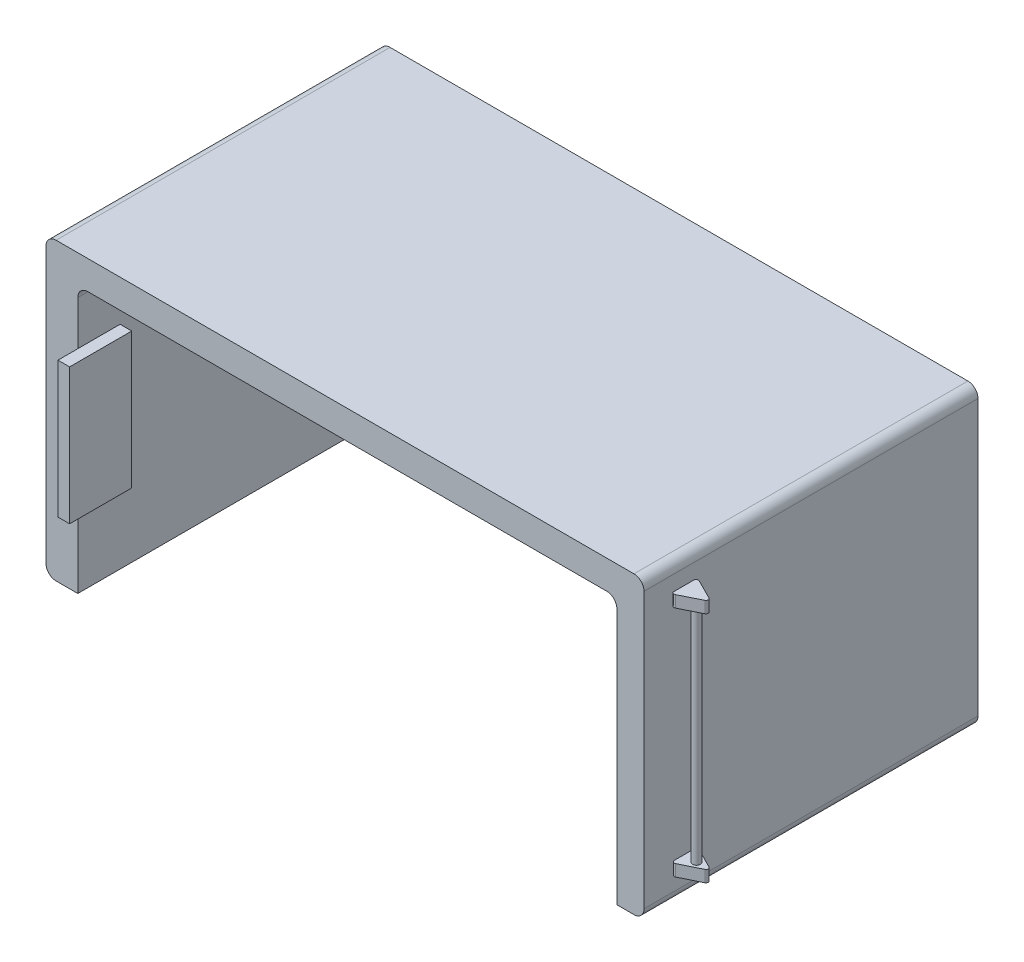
ISO-10303-21;
HEADER;
FILE_DESCRIPTION(('STEP AP214'),'2;1');
FILE_NAME('part.step','',(''),(''),'','','');
FILE_SCHEMA(('AUTOMOTIVE_DESIGN { 1 0 10303 214 1 1 1 1 }'));
ENDSEC;
DATA;
#1=APPLICATION_CONTEXT('core data for automotive mechanical design processes');
#2=APPLICATION_PROTOCOL_DEFINITION('international standard','automotive_design',2000,#1);
#3=PRODUCT_CONTEXT('',#1,'mechanical');
#4=PRODUCT('Part','Part','',(#3));
#5=PRODUCT_RELATED_PRODUCT_CATEGORY('part','',(#4));
#6=PRODUCT_DEFINITION_FORMATION('','',#4);
#7=PRODUCT_DEFINITION_CONTEXT('part definition',#1,'design');
#8=PRODUCT_DEFINITION('design','',#6,#7);
#9=PRODUCT_DEFINITION_SHAPE('','',#8);
#10=(LENGTH_UNIT() NAMED_UNIT(*) SI_UNIT(.MILLI.,.METRE.));
#11=(NAMED_UNIT(*) PLANE_ANGLE_UNIT() SI_UNIT($,.RADIAN.));
#12=(NAMED_UNIT(*) SI_UNIT($,.STERADIAN.) SOLID_ANGLE_UNIT());
#13=UNCERTAINTY_MEASURE_WITH_UNIT(LENGTH_MEASURE(1.E-05),#10,'distance_accuracy_value','');
#14=(GEOMETRIC_REPRESENTATION_CONTEXT(3) GLOBAL_UNCERTAINTY_ASSIGNED_CONTEXT((#13)) GLOBAL_UNIT_ASSIGNED_CONTEXT((#10,
#11,#12)) REPRESENTATION_CONTEXT('',''));
#15=CARTESIAN_POINT('',(0.,0.,0.));
#16=DIRECTION('',(0.,0.,1.));
#17=DIRECTION('',(1.,0.,0.));
#18=AXIS2_PLACEMENT_3D('',#15,#16,#17);
#19=CARTESIAN_POINT('',(-688.129187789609,-380.,860.));
#20=DIRECTION('',(-1.,0.,0.));
#21=DIRECTION('',(0.,0.,1.));
#22=AXIS2_PLACEMENT_3D('',#19,#20,#21);
#23=PLANE('',#22);
#24=DIRECTION('',(0.,0.,1.));
#25=VECTOR('',#24,1.);
#26=CARTESIAN_POINT('',(-688.129187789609,165.956022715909,751.059913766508));
#27=LINE('',#26,#25);
#28=CARTESIAN_POINT('',(-688.129187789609,165.956022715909,751.059913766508));
#29=VERTEX_POINT('',#28);
#30=CARTESIAN_POINT('',(-688.129187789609,165.956022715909,860.));
#31=VERTEX_POINT('',#30);
#32=EDGE_CURVE('E50',#29,#31,#27,.T.);
#33=ORIENTED_EDGE('',*,*,#32,.F.);
#34=DIRECTION('',(0.,1.,0.));
#35=VECTOR('',#34,1.);
#36=CARTESIAN_POINT('',(-688.129187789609,-184.043977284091,751.059913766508));
#37=LINE('',#36,#35);
#38=CARTESIAN_POINT('',(-688.129187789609,-184.043977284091,751.059913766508));
#39=VERTEX_POINT('',#38);
#40=EDGE_CURVE('E638',#39,#29,#37,.T.);
#41=ORIENTED_EDGE('',*,*,#40,.F.);
#42=DIRECTION('',(0.,0.,-1.));
#43=VECTOR('',#42,1.);
#44=CARTESIAN_POINT('',(-688.129187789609,-184.043977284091,751.059913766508));
#45=LINE('',#44,#43);
#46=CARTESIAN_POINT('',(-688.129187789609,-184.043977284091,860.));
#47=VERTEX_POINT('',#46);
#48=EDGE_CURVE('E683',#47,#39,#45,.T.);
#49=ORIENTED_EDGE('',*,*,#48,.F.);
#50=DIRECTION('',(0.,1.,0.));
#51=VECTOR('',#50,1.);
#52=CARTESIAN_POINT('',(-688.129187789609,-380.,860.));
#53=LINE('',#52,#51);
#54=CARTESIAN_POINT('',(-688.129187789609,-380.,860.));
#55=VERTEX_POINT('',#54);
#56=EDGE_CURVE('E795',#55,#47,#53,.T.);
#57=ORIENTED_EDGE('',*,*,#56,.F.);
#58=DIRECTION('',(0.,0.,-1.));
#59=VECTOR('',#58,1.);
#60=CARTESIAN_POINT('',(-688.129187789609,-380.,860.));
#61=LINE('',#60,#59);
#62=CARTESIAN_POINT('',(-688.129187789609,-380.,39.9999999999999));
#63=VERTEX_POINT('',#62);
#64=EDGE_CURVE('E848',#55,#63,#61,.T.);
#65=ORIENTED_EDGE('',*,*,#64,.T.);
#66=DIRECTION('',(0.,-1.,0.));
#67=VECTOR('',#66,1.);
#68=CARTESIAN_POINT('',(-688.129187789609,-380.,39.9999999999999));
#69=LINE('',#68,#67);
#70=CARTESIAN_POINT('',(-688.129187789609,280.184066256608,39.9999999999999));
#71=VERTEX_POINT('',#70);
#72=EDGE_CURVE('E762',#71,#63,#69,.T.);
#73=ORIENTED_EDGE('',*,*,#72,.F.);
#74=DIRECTION('',(0.,0.,-1.));
#75=VECTOR('',#74,1.);
#76=CARTESIAN_POINT('',(-688.129187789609,280.184066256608,860.));
#77=LINE('',#76,#75);
#78=CARTESIAN_POINT('',(-688.129187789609,280.184066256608,860.));
#79=VERTEX_POINT('',#78);
#80=EDGE_CURVE('E845',#79,#71,#77,.T.);
#81=ORIENTED_EDGE('',*,*,#80,.F.);
#82=EDGE_CURVE('E794',#31,#79,#53,.T.);
#83=ORIENTED_EDGE('',*,*,#82,.F.);
#84=EDGE_LOOP('',(#33,#41,#49,#57,#65,#73,#81,#83));
#85=FACE_BOUND('',#84,.T.);
#86=ADVANCED_FACE('F35',(#85),#23,.F.);
#87=CARTESIAN_POINT('',(826.583175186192,-285.,757.475724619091));
#88=DIRECTION('',(0.,-1.,0.));
#89=DIRECTION('',(0.,0.,-1.));
#90=AXIS2_PLACEMENT_3D('',#87,#88,#89);
#91=CYLINDRICAL_SURFACE('',#90,5.99999999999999);
#92=CARTESIAN_POINT('',(826.583175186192,-315.,757.475724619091));
#93=DIRECTION('',(0.,1.,0.));
#94=DIRECTION('',(0.,0.,-1.));
#95=AXIS2_PLACEMENT_3D('',#92,#93,#94);
#96=CIRCLE('',#95,5.99999999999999);
#97=CARTESIAN_POINT('',(829.223897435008,-315.,762.8633573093));
#98=VERTEX_POINT('',#97);
#99=CARTESIAN_POINT('',(829.308515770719,-315.,752.130397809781));
#100=VERTEX_POINT('',#99);
#101=EDGE_CURVE('E141',#98,#100,#96,.T.);
#102=ORIENTED_EDGE('',*,*,#101,.T.);
#103=DIRECTION('',(0.,-1.,0.));
#104=VECTOR('',#103,1.);
#105=CARTESIAN_POINT('',(829.308515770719,-285.,752.130397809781));
#106=LINE('',#105,#104);
#107=CARTESIAN_POINT('',(829.308515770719,-285.,752.130397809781));
#108=VERTEX_POINT('',#107);
#109=EDGE_CURVE('E11',#108,#100,#106,.T.);
#110=ORIENTED_EDGE('',*,*,#109,.F.);
#111=CARTESIAN_POINT('',(826.583175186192,-285.,757.475724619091));
#112=DIRECTION('',(0.,1.,0.));
#113=DIRECTION('',(0.,0.,-1.));
#114=AXIS2_PLACEMENT_3D('',#111,#112,#113);
#115=CIRCLE('',#114,5.99999999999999);
#116=CARTESIAN_POINT('',(829.223897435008,-285.,762.8633573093));
#117=VERTEX_POINT('',#116);
#118=EDGE_CURVE('E146',#117,#108,#115,.T.);
#119=ORIENTED_EDGE('',*,*,#118,.F.);
#120=DIRECTION('',(0.,-1.,0.));
#121=VECTOR('',#120,1.);
#122=CARTESIAN_POINT('',(829.223897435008,-285.,762.8633573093));
#123=LINE('',#122,#121);
#124=EDGE_CURVE('E125',#117,#98,#123,.T.);
#125=ORIENTED_EDGE('',*,*,#124,.T.);
#126=EDGE_LOOP('',(#102,#110,#119,#125));
#127=FACE_BOUND('',#126,.T.);
#128=ADVANCED_FACE('F37',(#127),#91,.T.);
#129=CARTESIAN_POINT('',(778.725340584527,-285.,726.340322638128));
#130=DIRECTION('',(-0.454223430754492,0.,0.890887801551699));
#131=DIRECTION('',(0.890887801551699,0.,0.454223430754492));
#132=AXIS2_PLACEMENT_3D('',#129,#130,#131);
#133=PLANE('',#132);
#134=DIRECTION('',(-0.890887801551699,0.,-0.454223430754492));
#135=VECTOR('',#134,1.);
#136=CARTESIAN_POINT('',(778.725340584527,-315.,726.340322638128));
#137=LINE('',#136,#135);
#138=CARTESIAN_POINT('',(778.725340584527,-315.,726.340322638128));
#139=VERTEX_POINT('',#138);
#140=EDGE_CURVE('E136',#100,#139,#137,.T.);
#141=ORIENTED_EDGE('',*,*,#140,.T.);
#142=DIRECTION('',(0.,-1.,0.));
#143=VECTOR('',#142,1.);
#144=CARTESIAN_POINT('',(778.725340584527,-285.,726.340322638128));
#145=LINE('',#144,#143);
#146=CARTESIAN_POINT('',(778.725340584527,-285.,726.340322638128));
#147=VERTEX_POINT('',#146);
#148=EDGE_CURVE('E43',#147,#139,#145,.T.);
#149=ORIENTED_EDGE('',*,*,#148,.F.);
#150=DIRECTION('',(-0.890887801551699,0.,-0.454223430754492));
#151=VECTOR('',#150,1.);
#152=CARTESIAN_POINT('',(778.725340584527,-285.,726.340322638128));
#153=LINE('',#152,#151);
#154=EDGE_CURVE('E91',#108,#147,#153,.T.);
#155=ORIENTED_EDGE('',*,*,#154,.F.);
#156=ORIENTED_EDGE('',*,*,#109,.T.);
#157=EDGE_LOOP('',(#141,#149,#155,#156));
#158=FACE_BOUND('',#157,.T.);
#159=ADVANCED_FACE('F165',(#158),#133,.F.);
#160=CARTESIAN_POINT('',(776.,-285.,731.685649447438));
#161=DIRECTION('',(0.,-1.,0.));
#162=DIRECTION('',(0.,0.,-1.));
#163=AXIS2_PLACEMENT_3D('',#160,#161,#162);
#164=CYLINDRICAL_SURFACE('',#163,5.99999999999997);
#165=CARTESIAN_POINT('',(776.,-315.,731.685649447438));
#166=DIRECTION('',(0.,1.,0.));
#167=DIRECTION('',(0.,0.,-1.));
#168=AXIS2_PLACEMENT_3D('',#165,#166,#167);
#169=CIRCLE('',#168,5.99999999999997);
#170=CARTESIAN_POINT('',(770.,-315.,731.685649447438));
#171=VERTEX_POINT('',#170);
#172=EDGE_CURVE('E132',#139,#171,#169,.T.);
#173=ORIENTED_EDGE('',*,*,#172,.T.);
#174=DIRECTION('',(0.,-1.,0.));
#175=VECTOR('',#174,1.);
#176=CARTESIAN_POINT('',(770.,-285.,731.685649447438));
#177=LINE('',#176,#175);
#178=CARTESIAN_POINT('',(770.,-285.,731.685649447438));
#179=VERTEX_POINT('',#178);
#180=EDGE_CURVE('E122',#179,#171,#177,.T.);
#181=ORIENTED_EDGE('',*,*,#180,.F.);
#182=CARTESIAN_POINT('',(776.,-285.,731.685649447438));
#183=DIRECTION('',(0.,1.,0.));
#184=DIRECTION('',(0.,0.,-1.));
#185=AXIS2_PLACEMENT_3D('',#182,#183,#184);
#186=CIRCLE('',#185,5.99999999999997);
#187=EDGE_CURVE('E106',#147,#179,#186,.T.);
#188=ORIENTED_EDGE('',*,*,#187,.F.);
#189=ORIENTED_EDGE('',*,*,#148,.T.);
#190=EDGE_LOOP('',(#173,#181,#188,#189));
#191=FACE_BOUND('',#190,.T.);
#192=ADVANCED_FACE('F131',(#191),#164,.T.);
#193=CARTESIAN_POINT('',(776.,-285.,782.26882463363));
#194=DIRECTION('',(0.,-1.,0.));
#195=DIRECTION('',(0.,0.,-1.));
#196=AXIS2_PLACEMENT_3D('',#193,#194,#195);
#197=CYLINDRICAL_SURFACE('',#196,5.99999999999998);
#198=CARTESIAN_POINT('',(776.,-315.,782.26882463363));
#199=DIRECTION('',(0.,1.,0.));
#200=DIRECTION('',(0.,0.,1.));
#201=AXIS2_PLACEMENT_3D('',#198,#199,#200);
#202=CIRCLE('',#201,5.99999999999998);
#203=CARTESIAN_POINT('',(770.,-315.,782.26882463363));
#204=VERTEX_POINT('',#203);
#205=CARTESIAN_POINT('',(778.640722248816,-315.,787.656457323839));
#206=VERTEX_POINT('',#205);
#207=EDGE_CURVE('E139',#204,#206,#202,.T.);
#208=ORIENTED_EDGE('',*,*,#207,.T.);
#209=DIRECTION('',(0.,-1.,0.));
#210=VECTOR('',#209,1.);
#211=CARTESIAN_POINT('',(778.640722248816,-285.,787.656457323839));
#212=LINE('',#211,#210);
#213=CARTESIAN_POINT('',(778.640722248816,-285.,787.656457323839));
#214=VERTEX_POINT('',#213);
#215=EDGE_CURVE('E117',#214,#206,#212,.T.);
#216=ORIENTED_EDGE('',*,*,#215,.F.);
#217=CARTESIAN_POINT('',(776.,-285.,782.26882463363));
#218=DIRECTION('',(0.,1.,0.));
#219=DIRECTION('',(0.,0.,1.));
#220=AXIS2_PLACEMENT_3D('',#217,#218,#219);
#221=CIRCLE('',#220,5.99999999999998);
#222=CARTESIAN_POINT('',(770.,-285.,782.26882463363));
#223=VERTEX_POINT('',#222);
#224=EDGE_CURVE('E103',#223,#214,#221,.T.);
#225=ORIENTED_EDGE('',*,*,#224,.F.);
#226=DIRECTION('',(0.,-1.,0.));
#227=VECTOR('',#226,1.);
#228=CARTESIAN_POINT('',(770.,-285.,782.26882463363));
#229=LINE('',#228,#227);
#230=EDGE_CURVE('E115',#223,#204,#229,.T.);
#231=ORIENTED_EDGE('',*,*,#230,.T.);
#232=EDGE_LOOP('',(#208,#216,#225,#231));
#233=FACE_BOUND('',#232,.T.);
#234=ADVANCED_FACE('F114',(#233),#197,.T.);
#235=CARTESIAN_POINT('',(829.223897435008,-285.,762.8633573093));
#236=DIRECTION('',(-0.440120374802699,0.,-0.897938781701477));
#237=DIRECTION('',(-0.897938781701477,0.,0.440120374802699));
#238=AXIS2_PLACEMENT_3D('',#235,#236,#237);
#239=PLANE('',#238);
#240=DIRECTION('',(0.897938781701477,0.,-0.440120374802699));
#241=VECTOR('',#240,1.);
#242=CARTESIAN_POINT('',(829.223897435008,-315.,762.8633573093));
#243=LINE('',#242,#241);
#244=EDGE_CURVE('E83',#206,#98,#243,.T.);
#245=ORIENTED_EDGE('',*,*,#244,.T.);
#246=ORIENTED_EDGE('',*,*,#124,.F.);
#247=DIRECTION('',(0.897938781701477,0.,-0.440120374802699));
#248=VECTOR('',#247,1.);
#249=CARTESIAN_POINT('',(829.223897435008,-285.,762.8633573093));
#250=LINE('',#249,#248);
#251=EDGE_CURVE('E59',#214,#117,#250,.T.);
#252=ORIENTED_EDGE('',*,*,#251,.F.);
#253=ORIENTED_EDGE('',*,*,#215,.T.);
#254=EDGE_LOOP('',(#245,#246,#252,#253));
#255=FACE_BOUND('',#254,.T.);
#256=ADVANCED_FACE('F220',(#255),#239,.F.);
#257=CARTESIAN_POINT('',(826.583175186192,-285.,757.475724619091));
#258=DIRECTION('',(0.,-1.,0.));
#259=DIRECTION('',(0.,0.,-1.));
#260=AXIS2_PLACEMENT_3D('',#257,#258,#259);
#261=PLANE('',#260);
#262=CARTESIAN_POINT('',(802.582988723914,-285.,757.475724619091));
#263=DIRECTION('',(0.,-1.,0.));
#264=DIRECTION('',(0.,0.,-1.));
#265=AXIS2_PLACEMENT_3D('',#262,#263,#264);
#266=CIRCLE('',#265,9.99999999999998);
#267=CARTESIAN_POINT('',(802.582988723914,-285.,767.475724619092));
#268=VERTEX_POINT('',#267);
#269=EDGE_CURVE('E151',#268,#268,#266,.T.);
#270=ORIENTED_EDGE('',*,*,#269,.T.);
#271=EDGE_LOOP('',(#270));
#272=FACE_BOUND('',#271,.T.);
#273=ORIENTED_EDGE('',*,*,#118,.T.);
#274=ORIENTED_EDGE('',*,*,#154,.T.);
#275=ORIENTED_EDGE('',*,*,#187,.T.);
#276=DIRECTION('',(0.,0.,1.));
#277=VECTOR('',#276,1.);
#278=CARTESIAN_POINT('',(770.,-285.,782.26882463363));
#279=LINE('',#278,#277);
#280=EDGE_CURVE('E100',#179,#223,#279,.T.);
#281=ORIENTED_EDGE('',*,*,#280,.T.);
#282=ORIENTED_EDGE('',*,*,#224,.T.);
#283=ORIENTED_EDGE('',*,*,#251,.T.);
#284=EDGE_LOOP('',(#273,#274,#275,#281,#282,#283));
#285=FACE_BOUND('',#284,.T.);
#286=ADVANCED_FACE('F102',(#272,#285),#261,.F.);
#287=CARTESIAN_POINT('',(826.583175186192,-315.,757.475724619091));
#288=DIRECTION('',(0.,-1.,0.));
#289=DIRECTION('',(0.,0.,-1.));
#290=AXIS2_PLACEMENT_3D('',#287,#288,#289);
#291=PLANE('',#290);
#292=ORIENTED_EDGE('',*,*,#101,.F.);
#293=ORIENTED_EDGE('',*,*,#244,.F.);
#294=ORIENTED_EDGE('',*,*,#207,.F.);
#295=DIRECTION('',(0.,0.,1.));
#296=VECTOR('',#295,1.);
#297=CARTESIAN_POINT('',(770.,-315.,782.26882463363));
#298=LINE('',#297,#296);
#299=EDGE_CURVE('E121',#171,#204,#298,.T.);
#300=ORIENTED_EDGE('',*,*,#299,.F.);
#301=ORIENTED_EDGE('',*,*,#172,.F.);
#302=ORIENTED_EDGE('',*,*,#140,.F.);
#303=EDGE_LOOP('',(#292,#293,#294,#300,#301,#302));
#304=FACE_BOUND('',#303,.T.);
#305=ADVANCED_FACE('F135',(#304),#291,.T.);
#306=CARTESIAN_POINT('',(802.582988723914,-285.,757.475724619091));
#307=DIRECTION('',(0.,1.,0.));
#308=DIRECTION('',(0.,0.,1.));
#309=AXIS2_PLACEMENT_3D('',#306,#307,#308);
#310=CYLINDRICAL_SURFACE('',#309,9.99999999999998);
#311=CARTESIAN_POINT('',(802.582988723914,285.,757.475724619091));
#312=DIRECTION('',(0.,1.,0.));
#313=DIRECTION('',(0.,0.,1.));
#314=AXIS2_PLACEMENT_3D('',#311,#312,#313);
#315=CIRCLE('',#314,9.99999999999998);
#316=CARTESIAN_POINT('',(802.582988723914,285.,767.475724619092));
#317=VERTEX_POINT('',#316);
#318=EDGE_CURVE('E154',#317,#317,#315,.T.);
#319=CARTESIAN_POINT('',(802.582988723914,-285.,767.475724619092));
#320=CARTESIAN_POINT('',(802.582988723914,-279.0625,767.475724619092));
#321=CARTESIAN_POINT('',(802.582988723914,-273.125,767.475724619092));
#322=CARTESIAN_POINT('',(802.582988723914,-261.25,767.475724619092));
#323=CARTESIAN_POINT('',(802.582988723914,-255.3125,767.475724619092));
#324=CARTESIAN_POINT('',(802.582988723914,-243.4375,767.475724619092));
#325=CARTESIAN_POINT('',(802.582988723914,-237.5,767.475724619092));
#326=CARTESIAN_POINT('',(802.582988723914,-225.625,767.475724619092));
#327=CARTESIAN_POINT('',(802.582988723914,-219.6875,767.475724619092));
#328=CARTESIAN_POINT('',(802.582988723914,-207.8125,767.475724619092));
#329=CARTESIAN_POINT('',(802.582988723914,-201.875,767.475724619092));
#330=CARTESIAN_POINT('',(802.582988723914,-190.,767.475724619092));
#331=CARTESIAN_POINT('',(802.582988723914,-184.0625,767.475724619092));
#332=CARTESIAN_POINT('',(802.582988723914,-172.1875,767.475724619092));
#333=CARTESIAN_POINT('',(802.582988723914,-166.25,767.475724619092));
#334=CARTESIAN_POINT('',(802.582988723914,-154.375,767.475724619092));
#335=CARTESIAN_POINT('',(802.582988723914,-148.4375,767.475724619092));
#336=CARTESIAN_POINT('',(802.582988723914,-136.5625,767.475724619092));
#337=CARTESIAN_POINT('',(802.582988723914,-130.625,767.475724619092));
#338=CARTESIAN_POINT('',(802.582988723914,-118.75,767.475724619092));
#339=CARTESIAN_POINT('',(802.582988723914,-112.8125,767.475724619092));
#340=CARTESIAN_POINT('',(802.582988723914,-100.9375,767.475724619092));
#341=CARTESIAN_POINT('',(802.582988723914,-95.0000000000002,767.475724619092));
#342=CARTESIAN_POINT('',(802.582988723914,-83.1250000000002,767.475724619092));
#343=CARTESIAN_POINT('',(802.582988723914,-77.1875000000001,767.475724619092));
#344=CARTESIAN_POINT('',(802.582988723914,-65.3125000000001,767.475724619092));
#345=CARTESIAN_POINT('',(802.582988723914,-59.3750000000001,767.475724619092));
#346=CARTESIAN_POINT('',(802.582988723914,-47.5000000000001,767.475724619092));
#347=CARTESIAN_POINT('',(802.582988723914,-41.5625000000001,767.475724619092));
#348=CARTESIAN_POINT('',(802.582988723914,-29.6875000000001,767.475724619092));
#349=CARTESIAN_POINT('',(802.582988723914,-23.7500000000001,767.475724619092));
#350=CARTESIAN_POINT('',(802.582988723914,-11.8750000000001,767.475724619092));
#351=CARTESIAN_POINT('',(802.582988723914,-5.93750000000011,767.475724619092));
#352=CARTESIAN_POINT('',(802.582988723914,5.93749999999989,767.475724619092));
#353=CARTESIAN_POINT('',(802.582988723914,11.8749999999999,767.475724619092));
#354=CARTESIAN_POINT('',(802.582988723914,23.7499999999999,767.475724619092));
#355=CARTESIAN_POINT('',(802.582988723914,29.6874999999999,767.475724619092));
#356=CARTESIAN_POINT('',(802.582988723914,41.5624999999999,767.475724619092));
#357=CARTESIAN_POINT('',(802.582988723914,47.4999999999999,767.475724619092));
#358=CARTESIAN_POINT('',(802.582988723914,59.3749999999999,767.475724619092));
#359=CARTESIAN_POINT('',(802.582988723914,65.3124999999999,767.475724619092));
#360=CARTESIAN_POINT('',(802.582988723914,77.1874999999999,767.475724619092));
#361=CARTESIAN_POINT('',(802.582988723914,83.1249999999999,767.475724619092));
#362=CARTESIAN_POINT('',(802.582988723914,94.9999999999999,767.475724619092));
#363=CARTESIAN_POINT('',(802.582988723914,100.9375,767.475724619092));
#364=CARTESIAN_POINT('',(802.582988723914,112.8125,767.475724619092));
#365=CARTESIAN_POINT('',(802.582988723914,118.75,767.475724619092));
#366=CARTESIAN_POINT('',(802.582988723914,130.625,767.475724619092));
#367=CARTESIAN_POINT('',(802.582988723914,136.5625,767.475724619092));
#368=CARTESIAN_POINT('',(802.582988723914,148.4375,767.475724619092));
#369=CARTESIAN_POINT('',(802.582988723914,154.375,767.475724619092));
#370=CARTESIAN_POINT('',(802.582988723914,166.25,767.475724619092));
#371=CARTESIAN_POINT('',(802.582988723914,172.1875,767.475724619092));
#372=CARTESIAN_POINT('',(802.582988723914,184.0625,767.475724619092));
#373=CARTESIAN_POINT('',(802.582988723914,190.,767.475724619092));
#374=CARTESIAN_POINT('',(802.582988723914,201.875,767.475724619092));
#375=CARTESIAN_POINT('',(802.582988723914,207.8125,767.475724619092));
#376=CARTESIAN_POINT('',(802.582988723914,219.6875,767.475724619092));
#377=CARTESIAN_POINT('',(802.582988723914,225.625,767.475724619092));
#378=CARTESIAN_POINT('',(802.582988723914,237.5,767.475724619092));
#379=CARTESIAN_POINT('',(802.582988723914,243.4375,767.475724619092));
#380=CARTESIAN_POINT('',(802.582988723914,255.3125,767.475724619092));
#381=CARTESIAN_POINT('',(802.582988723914,261.25,767.475724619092));
#382=CARTESIAN_POINT('',(802.582988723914,273.125,767.475724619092));
#383=CARTESIAN_POINT('',(802.582988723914,279.0625,767.475724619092));
#384=CARTESIAN_POINT('',(802.582988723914,285.,767.475724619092));
#385=B_SPLINE_CURVE_WITH_KNOTS('',3,(#319,#320,#321,#322,#323,#324,#325,#326,#327,#328,#329,
#330,#331,#332,#333,#334,#335,#336,#337,#338,#339,#340,#341,#342,#343,#344,#345,#346,#347,#348,
#349,#350,#351,#352,#353,#354,#355,#356,#357,#358,#359,#360,#361,#362,#363,#364,#365,#366,#367,
#368,#369,#370,#371,#372,#373,#374,#375,#376,#377,#378,#379,#380,#381,#382,#383,#384),
.UNSPECIFIED.,.F.,.F.,(4,2,2,2,2,2,2,2,2,2,2,2,2,2,2,2,2,2,2,2,2,2,2,2,2,2,2,2,2,2,2,2,4),(0.,
17.8125,35.625,53.4375,71.25,89.0625,106.875,124.6875,142.5,160.3125,178.125,195.9375,213.75,
231.5625,249.375,267.1875,285.,302.8125,320.625,338.4375,356.25,374.0625,391.875,409.6875,427.5,
445.3125,463.125,480.9375,498.75,516.5625,534.375,552.1875,570.),.UNSPECIFIED.);
#386=EDGE_CURVE('BSEAM209',#268,#317,#385,.T.);
#387=ORIENTED_EDGE('',*,*,#269,.F.);
#388=ORIENTED_EDGE('',*,*,#318,.F.);
#389=ORIENTED_EDGE('',*,*,#386,.T.);
#390=ORIENTED_EDGE('',*,*,#386,.F.);
#391=EDGE_LOOP('',(#387,#389,#388,#390));
#392=FACE_BOUND('',#391,.T.);
#393=ADVANCED_FACE('F209',(#392),#310,.T.);
#394=CARTESIAN_POINT('',(770.,354.,860.));
#395=DIRECTION('',(-1.,0.,0.));
#396=DIRECTION('',(0.,-1.,0.));
#397=AXIS2_PLACEMENT_3D('',#394,#395,#396);
#398=PLANE('',#397);
#399=DIRECTION('',(0.,-1.,0.));
#400=VECTOR('',#399,1.);
#401=CARTESIAN_POINT('',(770.,315.,782.650929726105));
#402=LINE('',#401,#400);
#403=CARTESIAN_POINT('',(770.,315.,782.650929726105));
#404=VERTEX_POINT('',#403);
#405=CARTESIAN_POINT('',(770.,285.,782.650929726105));
#406=VERTEX_POINT('',#405);
#407=EDGE_CURVE('E738',#404,#406,#402,.T.);
#408=ORIENTED_EDGE('',*,*,#407,.F.);
#409=DIRECTION('',(0.,0.,1.));
#410=VECTOR('',#409,1.);
#411=CARTESIAN_POINT('',(770.,315.,732.067349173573));
#412=LINE('',#411,#410);
#413=CARTESIAN_POINT('',(770.,315.,732.067349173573));
#414=VERTEX_POINT('',#413);
#415=EDGE_CURVE('E707',#414,#404,#412,.T.);
#416=ORIENTED_EDGE('',*,*,#415,.F.);
#417=DIRECTION('',(0.,-1.,0.));
#418=VECTOR('',#417,1.);
#419=CARTESIAN_POINT('',(770.,315.,732.067349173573));
#420=LINE('',#419,#418);
#421=CARTESIAN_POINT('',(770.,285.,732.067349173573));
#422=VERTEX_POINT('',#421);
#423=EDGE_CURVE('E741',#414,#422,#420,.T.);
#424=ORIENTED_EDGE('',*,*,#423,.T.);
#425=DIRECTION('',(0.,0.,1.));
#426=VECTOR('',#425,1.);
#427=CARTESIAN_POINT('',(770.,285.,732.067349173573));
#428=LINE('',#427,#426);
#429=EDGE_CURVE('E725',#422,#406,#428,.T.);
#430=ORIENTED_EDGE('',*,*,#429,.T.);
#431=EDGE_LOOP('',(#408,#416,#424,#430));
#432=FACE_BOUND('',#431,.T.);
#433=DIRECTION('',(0.,1.,0.));
#434=VECTOR('',#433,1.);
#435=CARTESIAN_POINT('',(770.,354.,0.));
#436=LINE('',#435,#434);
#437=CARTESIAN_POINT('',(770.,-354.,0.));
#438=VERTEX_POINT('',#437);
#439=CARTESIAN_POINT('',(770.,354.,0.));
#440=VERTEX_POINT('',#439);
#441=EDGE_CURVE('E814',#438,#440,#436,.T.);
#442=ORIENTED_EDGE('',*,*,#441,.T.);
#443=DIRECTION('',(0.,0.,-1.));
#444=VECTOR('',#443,1.);
#445=CARTESIAN_POINT('',(770.,354.,860.));
#446=LINE('',#445,#444);
#447=CARTESIAN_POINT('',(770.,354.,860.));
#448=VERTEX_POINT('',#447);
#449=EDGE_CURVE('E866',#448,#440,#446,.T.);
#450=ORIENTED_EDGE('',*,*,#449,.F.);
#451=DIRECTION('',(0.,1.,0.));
#452=VECTOR('',#451,1.);
#453=CARTESIAN_POINT('',(770.,354.,860.));
#454=LINE('',#453,#452);
#455=CARTESIAN_POINT('',(770.,-354.,860.));
#456=VERTEX_POINT('',#455);
#457=EDGE_CURVE('E773',#456,#448,#454,.T.);
#458=ORIENTED_EDGE('',*,*,#457,.F.);
#459=DIRECTION('',(0.,0.,-1.));
#460=VECTOR('',#459,1.);
#461=CARTESIAN_POINT('',(770.,-354.,860.));
#462=LINE('',#461,#460);
#463=EDGE_CURVE('E869',#456,#438,#462,.T.);
#464=ORIENTED_EDGE('',*,*,#463,.T.);
#465=EDGE_LOOP('',(#442,#450,#458,#464));
#466=FACE_BOUND('',#465,.T.);
#467=ORIENTED_EDGE('',*,*,#230,.F.);
#468=ORIENTED_EDGE('',*,*,#280,.F.);
#469=ORIENTED_EDGE('',*,*,#180,.T.);
#470=ORIENTED_EDGE('',*,*,#299,.T.);
#471=EDGE_LOOP('',(#467,#468,#469,#470));
#472=FACE_BOUND('',#471,.T.);
#473=ADVANCED_FACE('F119',(#432,#466,#472),#398,.F.);
#474=CARTESIAN_POINT('',(-662.129187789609,280.184066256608,860.));
#475=DIRECTION('',(0.,0.,-1.));
#476=DIRECTION('',(-1.,0.,0.));
#477=AXIS2_PLACEMENT_3D('',#474,#475,#476);
#478=CYLINDRICAL_SURFACE('',#477,26.);
#479=CARTESIAN_POINT('',(-662.129187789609,280.184066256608,39.9999999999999));
#480=DIRECTION('',(0.,0.,-1.));
#481=DIRECTION('',(-1.,0.,0.));
#482=AXIS2_PLACEMENT_3D('',#479,#480,#481);
#483=CIRCLE('',#482,26.);
#484=CARTESIAN_POINT('',(-662.129187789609,306.184066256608,39.9999999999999));
#485=VERTEX_POINT('',#484);
#486=EDGE_CURVE('E759',#485,#71,#483,.F.);
#487=ORIENTED_EDGE('',*,*,#486,.F.);
#488=DIRECTION('',(0.,0.,-1.));
#489=VECTOR('',#488,1.);
#490=CARTESIAN_POINT('',(-662.129187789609,306.184066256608,860.));
#491=LINE('',#490,#489);
#492=CARTESIAN_POINT('',(-662.129187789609,306.184066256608,860.));
#493=VERTEX_POINT('',#492);
#494=EDGE_CURVE('E842',#493,#485,#491,.T.);
#495=ORIENTED_EDGE('',*,*,#494,.F.);
#496=CARTESIAN_POINT('',(-662.129187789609,280.184066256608,860.));
#497=DIRECTION('',(0.,0.,-1.));
#498=DIRECTION('',(-1.,0.,0.));
#499=AXIS2_PLACEMENT_3D('',#496,#497,#498);
#500=CIRCLE('',#499,26.);
#501=EDGE_CURVE('E798',#79,#493,#500,.T.);
#502=ORIENTED_EDGE('',*,*,#501,.F.);
#503=ORIENTED_EDGE('',*,*,#80,.T.);
#504=EDGE_LOOP('',(#487,#495,#502,#503));
#505=FACE_BOUND('',#504,.T.);
#506=ADVANCED_FACE('F179',(#505),#478,.F.);
#507=CARTESIAN_POINT('',(-662.129187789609,306.184066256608,860.));
#508=DIRECTION('',(0.,1.,0.));
#509=DIRECTION('',(-1.,0.,0.));
#510=AXIS2_PLACEMENT_3D('',#507,#508,#509);
#511=PLANE('',#510);
#512=DIRECTION('',(-1.,0.,0.));
#513=VECTOR('',#512,1.);
#514=CARTESIAN_POINT('',(-662.129187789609,306.184066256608,39.9999999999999));
#515=LINE('',#514,#513);
#516=CARTESIAN_POINT('',(674.,306.184066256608,39.9999999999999));
#517=VERTEX_POINT('',#516);
#518=EDGE_CURVE('E756',#517,#485,#515,.T.);
#519=ORIENTED_EDGE('',*,*,#518,.F.);
#520=DIRECTION('',(0.,0.,-1.));
#521=VECTOR('',#520,1.);
#522=CARTESIAN_POINT('',(674.,306.184066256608,860.));
#523=LINE('',#522,#521);
#524=CARTESIAN_POINT('',(674.,306.184066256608,860.));
#525=VERTEX_POINT('',#524);
#526=EDGE_CURVE('E839',#525,#517,#523,.T.);
#527=ORIENTED_EDGE('',*,*,#526,.F.);
#528=DIRECTION('',(1.,0.,0.));
#529=VECTOR('',#528,1.);
#530=CARTESIAN_POINT('',(-662.129187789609,306.184066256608,860.));
#531=LINE('',#530,#529);
#532=EDGE_CURVE('E802',#493,#525,#531,.T.);
#533=ORIENTED_EDGE('',*,*,#532,.F.);
#534=ORIENTED_EDGE('',*,*,#494,.T.);
#535=EDGE_LOOP('',(#519,#527,#533,#534));
#536=FACE_BOUND('',#535,.T.);
#537=ADVANCED_FACE('F259',(#536),#511,.F.);
#538=CARTESIAN_POINT('',(674.,280.184066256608,860.));
#539=DIRECTION('',(0.,0.,-1.));
#540=DIRECTION('',(-1.,0.,0.));
#541=AXIS2_PLACEMENT_3D('',#538,#539,#540);
#542=CYLINDRICAL_SURFACE('',#541,26.);
#543=CARTESIAN_POINT('',(674.,280.184066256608,39.9999999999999));
#544=DIRECTION('',(0.,0.,-1.));
#545=DIRECTION('',(-1.,0.,0.));
#546=AXIS2_PLACEMENT_3D('',#543,#544,#545);
#547=CIRCLE('',#546,26.);
#548=CARTESIAN_POINT('',(700.,280.184066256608,39.9999999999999));
#549=VERTEX_POINT('',#548);
#550=EDGE_CURVE('E753',#549,#517,#547,.F.);
#551=ORIENTED_EDGE('',*,*,#550,.F.);
#552=DIRECTION('',(0.,0.,-1.));
#553=VECTOR('',#552,1.);
#554=CARTESIAN_POINT('',(700.,280.184066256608,860.));
#555=LINE('',#554,#553);
#556=CARTESIAN_POINT('',(700.,280.184066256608,860.));
#557=VERTEX_POINT('',#556);
#558=EDGE_CURVE('E836',#557,#549,#555,.T.);
#559=ORIENTED_EDGE('',*,*,#558,.F.);
#560=CARTESIAN_POINT('',(674.,280.184066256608,860.));
#561=DIRECTION('',(0.,0.,-1.));
#562=DIRECTION('',(-1.,0.,0.));
#563=AXIS2_PLACEMENT_3D('',#560,#561,#562);
#564=CIRCLE('',#563,26.);
#565=EDGE_CURVE('E805',#525,#557,#564,.T.);
#566=ORIENTED_EDGE('',*,*,#565,.F.);
#567=ORIENTED_EDGE('',*,*,#526,.T.);
#568=EDGE_LOOP('',(#551,#559,#566,#567));
#569=FACE_BOUND('',#568,.T.);
#570=ADVANCED_FACE('F267',(#569),#542,.F.);
#571=CARTESIAN_POINT('',(700.,280.184066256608,860.));
#572=DIRECTION('',(1.,0.,0.));
#573=DIRECTION('',(0.,1.,0.));
#574=AXIS2_PLACEMENT_3D('',#571,#572,#573);
#575=PLANE('',#574);
#576=DIRECTION('',(0.,1.,0.));
#577=VECTOR('',#576,1.);
#578=CARTESIAN_POINT('',(700.,280.184066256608,39.9999999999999));
#579=LINE('',#578,#577);
#580=CARTESIAN_POINT('',(700.,-380.,39.9999999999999));
#581=VERTEX_POINT('',#580);
#582=EDGE_CURVE('E159',#581,#549,#579,.T.);
#583=ORIENTED_EDGE('',*,*,#582,.F.);
#584=DIRECTION('',(0.,0.,-1.));
#585=VECTOR('',#584,1.);
#586=CARTESIAN_POINT('',(700.,-380.,860.));
#587=LINE('',#586,#585);
#588=CARTESIAN_POINT('',(700.,-380.,860.));
#589=VERTEX_POINT('',#588);
#590=EDGE_CURVE('E811',#589,#581,#587,.T.);
#591=ORIENTED_EDGE('',*,*,#590,.F.);
#592=DIRECTION('',(0.,-1.,0.));
#593=VECTOR('',#592,1.);
#594=CARTESIAN_POINT('',(700.,280.184066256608,860.));
#595=LINE('',#594,#593);
#596=EDGE_CURVE('E808',#557,#589,#595,.T.);
#597=ORIENTED_EDGE('',*,*,#596,.F.);
#598=ORIENTED_EDGE('',*,*,#558,.T.);
#599=EDGE_LOOP('',(#583,#591,#597,#598));
#600=FACE_BOUND('',#599,.T.);
#601=ADVANCED_FACE('F213',(#600),#575,.F.);
#602=CARTESIAN_POINT('',(744.,-354.,860.));
#603=DIRECTION('',(0.,0.,-1.));
#604=DIRECTION('',(-1.,0.,0.));
#605=AXIS2_PLACEMENT_3D('',#602,#603,#604);
#606=CYLINDRICAL_SURFACE('',#605,26.);
#607=CARTESIAN_POINT('',(744.,-354.,0.));
#608=DIRECTION('',(0.,0.,1.));
#609=DIRECTION('',(1.,0.,0.));
#610=AXIS2_PLACEMENT_3D('',#607,#608,#609);
#611=CIRCLE('',#610,26.);
#612=CARTESIAN_POINT('',(744.,-380.,0.));
#613=VERTEX_POINT('',#612);
#614=EDGE_CURVE('E765',#613,#438,#611,.T.);
#615=ORIENTED_EDGE('',*,*,#614,.T.);
#616=ORIENTED_EDGE('',*,*,#463,.F.);
#617=CARTESIAN_POINT('',(744.,-354.,860.));
#618=DIRECTION('',(0.,0.,1.));
#619=DIRECTION('',(1.,0.,0.));
#620=AXIS2_PLACEMENT_3D('',#617,#618,#619);
#621=CIRCLE('',#620,26.);
#622=CARTESIAN_POINT('',(744.,-380.,860.));
#623=VERTEX_POINT('',#622);
#624=EDGE_CURVE('E769',#623,#456,#621,.T.);
#625=ORIENTED_EDGE('',*,*,#624,.F.);
#626=DIRECTION('',(0.,0.,-1.));
#627=VECTOR('',#626,1.);
#628=CARTESIAN_POINT('',(744.,-380.,860.));
#629=LINE('',#628,#627);
#630=EDGE_CURVE('E872',#623,#613,#629,.T.);
#631=ORIENTED_EDGE('',*,*,#630,.T.);
#632=EDGE_LOOP('',(#615,#616,#625,#631));
#633=FACE_BOUND('',#632,.T.);
#634=ADVANCED_FACE('F205',(#633),#606,.T.);
#635=CARTESIAN_POINT('',(744.,354.,860.));
#636=DIRECTION('',(0.,0.,-1.));
#637=DIRECTION('',(-1.,0.,0.));
#638=AXIS2_PLACEMENT_3D('',#635,#636,#637);
#639=CYLINDRICAL_SURFACE('',#638,26.);
#640=CARTESIAN_POINT('',(744.,354.,0.));
#641=DIRECTION('',(0.,0.,1.));
#642=DIRECTION('',(-1.,0.,0.));
#643=AXIS2_PLACEMENT_3D('',#640,#641,#642);
#644=CIRCLE('',#643,26.);
#645=CARTESIAN_POINT('',(744.,380.,0.));
#646=VERTEX_POINT('',#645);
#647=EDGE_CURVE('E817',#440,#646,#644,.T.);
#648=ORIENTED_EDGE('',*,*,#647,.T.);
#649=DIRECTION('',(0.,0.,-1.));
#650=VECTOR('',#649,1.);
#651=CARTESIAN_POINT('',(744.,380.,860.));
#652=LINE('',#651,#650);
#653=CARTESIAN_POINT('',(744.,380.,860.));
#654=VERTEX_POINT('',#653);
#655=EDGE_CURVE('E863',#654,#646,#652,.T.);
#656=ORIENTED_EDGE('',*,*,#655,.F.);
#657=CARTESIAN_POINT('',(744.,354.,860.));
#658=DIRECTION('',(0.,0.,1.));
#659=DIRECTION('',(-1.,0.,0.));
#660=AXIS2_PLACEMENT_3D('',#657,#658,#659);
#661=CIRCLE('',#660,26.);
#662=EDGE_CURVE('E776',#448,#654,#661,.T.);
#663=ORIENTED_EDGE('',*,*,#662,.F.);
#664=ORIENTED_EDGE('',*,*,#449,.T.);
#665=EDGE_LOOP('',(#648,#656,#663,#664));
#666=FACE_BOUND('',#665,.T.);
#667=ADVANCED_FACE('F201',(#666),#639,.T.);
#668=CARTESIAN_POINT('',(-744.,380.,860.));
#669=DIRECTION('',(0.,-1.,0.));
#670=DIRECTION('',(0.,0.,-1.));
#671=AXIS2_PLACEMENT_3D('',#668,#669,#670);
#672=PLANE('',#671);
#673=DIRECTION('',(-1.,0.,0.));
#674=VECTOR('',#673,1.);
#675=CARTESIAN_POINT('',(-744.,380.,0.));
#676=LINE('',#675,#674);
#677=CARTESIAN_POINT('',(-744.,380.,0.));
#678=VERTEX_POINT('',#677);
#679=EDGE_CURVE('E820',#646,#678,#676,.T.);
#680=ORIENTED_EDGE('',*,*,#679,.T.);
#681=DIRECTION('',(0.,0.,-1.));
#682=VECTOR('',#681,1.);
#683=CARTESIAN_POINT('',(-744.,380.,860.));
#684=LINE('',#683,#682);
#685=CARTESIAN_POINT('',(-744.,380.,860.));
#686=VERTEX_POINT('',#685);
#687=EDGE_CURVE('E860',#686,#678,#684,.T.);
#688=ORIENTED_EDGE('',*,*,#687,.F.);
#689=DIRECTION('',(-1.,0.,0.));
#690=VECTOR('',#689,1.);
#691=CARTESIAN_POINT('',(-744.,380.,860.));
#692=LINE('',#691,#690);
#693=EDGE_CURVE('E779',#654,#686,#692,.T.);
#694=ORIENTED_EDGE('',*,*,#693,.F.);
#695=ORIENTED_EDGE('',*,*,#655,.T.);
#696=EDGE_LOOP('',(#680,#688,#694,#695));
#697=FACE_BOUND('',#696,.T.);
#698=ADVANCED_FACE('F197',(#697),#672,.F.);
#699=CARTESIAN_POINT('',(-744.,354.,860.));
#700=DIRECTION('',(0.,0.,-1.));
#701=DIRECTION('',(-1.,0.,0.));
#702=AXIS2_PLACEMENT_3D('',#699,#700,#701);
#703=CYLINDRICAL_SURFACE('',#702,26.);
#704=CARTESIAN_POINT('',(-744.,354.,0.));
#705=DIRECTION('',(0.,0.,1.));
#706=DIRECTION('',(1.,0.,0.));
#707=AXIS2_PLACEMENT_3D('',#704,#705,#706);
#708=CIRCLE('',#707,26.);
#709=CARTESIAN_POINT('',(-770.,354.,0.));
#710=VERTEX_POINT('',#709);
#711=EDGE_CURVE('E823',#678,#710,#708,.T.);
#712=ORIENTED_EDGE('',*,*,#711,.T.);
#713=DIRECTION('',(0.,0.,-1.));
#714=VECTOR('',#713,1.);
#715=CARTESIAN_POINT('',(-770.,354.,860.));
#716=LINE('',#715,#714);
#717=CARTESIAN_POINT('',(-770.,354.,860.));
#718=VERTEX_POINT('',#717);
#719=EDGE_CURVE('E857',#718,#710,#716,.T.);
#720=ORIENTED_EDGE('',*,*,#719,.F.);
#721=CARTESIAN_POINT('',(-744.,354.,860.));
#722=DIRECTION('',(0.,0.,1.));
#723=DIRECTION('',(1.,0.,0.));
#724=AXIS2_PLACEMENT_3D('',#721,#722,#723);
#725=CIRCLE('',#724,26.);
#726=EDGE_CURVE('E782',#686,#718,#725,.T.);
#727=ORIENTED_EDGE('',*,*,#726,.F.);
#728=ORIENTED_EDGE('',*,*,#687,.T.);
#729=EDGE_LOOP('',(#712,#720,#727,#728));
#730=FACE_BOUND('',#729,.T.);
#731=ADVANCED_FACE('F193',(#730),#703,.T.);
#732=CARTESIAN_POINT('',(-770.,354.,860.));
#733=DIRECTION('',(1.,0.,0.));
#734=DIRECTION('',(0.,1.,0.));
#735=AXIS2_PLACEMENT_3D('',#732,#733,#734);
#736=PLANE('',#735);
#737=DIRECTION('',(0.,-1.,0.));
#738=VECTOR('',#737,1.);
#739=CARTESIAN_POINT('',(-770.,354.,0.));
#740=LINE('',#739,#738);
#741=CARTESIAN_POINT('',(-770.,-354.,0.));
#742=VERTEX_POINT('',#741);
#743=EDGE_CURVE('E826',#710,#742,#740,.T.);
#744=ORIENTED_EDGE('',*,*,#743,.T.);
#745=DIRECTION('',(0.,0.,-1.));
#746=VECTOR('',#745,1.);
#747=CARTESIAN_POINT('',(-770.,-354.,860.));
#748=LINE('',#747,#746);
#749=CARTESIAN_POINT('',(-770.,-354.,860.));
#750=VERTEX_POINT('',#749);
#751=EDGE_CURVE('E854',#750,#742,#748,.T.);
#752=ORIENTED_EDGE('',*,*,#751,.F.);
#753=DIRECTION('',(0.,-1.,0.));
#754=VECTOR('',#753,1.);
#755=CARTESIAN_POINT('',(-770.,354.,860.));
#756=LINE('',#755,#754);
#757=EDGE_CURVE('E785',#718,#750,#756,.T.);
#758=ORIENTED_EDGE('',*,*,#757,.F.);
#759=ORIENTED_EDGE('',*,*,#719,.T.);
#760=EDGE_LOOP('',(#744,#752,#758,#759));
#761=FACE_BOUND('',#760,.T.);
#762=ADVANCED_FACE('F189',(#761),#736,.F.);
#763=CARTESIAN_POINT('',(-744.,-354.,860.));
#764=DIRECTION('',(0.,0.,-1.));
#765=DIRECTION('',(-1.,0.,0.));
#766=AXIS2_PLACEMENT_3D('',#763,#764,#765);
#767=CYLINDRICAL_SURFACE('',#766,26.);
#768=CARTESIAN_POINT('',(-744.,-354.,0.));
#769=DIRECTION('',(0.,0.,1.));
#770=DIRECTION('',(1.,0.,0.));
#771=AXIS2_PLACEMENT_3D('',#768,#769,#770);
#772=CIRCLE('',#771,26.);
#773=CARTESIAN_POINT('',(-744.,-380.,0.));
#774=VERTEX_POINT('',#773);
#775=EDGE_CURVE('E829',#742,#774,#772,.T.);
#776=ORIENTED_EDGE('',*,*,#775,.T.);
#777=DIRECTION('',(0.,0.,-1.));
#778=VECTOR('',#777,1.);
#779=CARTESIAN_POINT('',(-744.,-380.,860.));
#780=LINE('',#779,#778);
#781=CARTESIAN_POINT('',(-744.,-380.,860.));
#782=VERTEX_POINT('',#781);
#783=EDGE_CURVE('E851',#782,#774,#780,.T.);
#784=ORIENTED_EDGE('',*,*,#783,.F.);
#785=CARTESIAN_POINT('',(-744.,-354.,860.));
#786=DIRECTION('',(0.,0.,1.));
#787=DIRECTION('',(1.,0.,0.));
#788=AXIS2_PLACEMENT_3D('',#785,#786,#787);
#789=CIRCLE('',#788,26.);
#790=EDGE_CURVE('E788',#750,#782,#789,.T.);
#791=ORIENTED_EDGE('',*,*,#790,.F.);
#792=ORIENTED_EDGE('',*,*,#751,.T.);
#793=EDGE_LOOP('',(#776,#784,#791,#792));
#794=FACE_BOUND('',#793,.T.);
#795=ADVANCED_FACE('F185',(#794),#767,.T.);
#796=CARTESIAN_POINT('',(-744.,-380.,860.));
#797=DIRECTION('',(0.,1.,0.));
#798=DIRECTION('',(-1.,0.,0.));
#799=AXIS2_PLACEMENT_3D('',#796,#797,#798);
#800=PLANE('',#799);
#801=CARTESIAN_POINT('',(-708.,-380.,693.));
#802=DIRECTION('',(0.,-1.,0.));
#803=DIRECTION('',(1.,0.,0.));
#804=AXIS2_PLACEMENT_3D('',#801,#802,#803);
#805=CIRCLE('',#804,5.00000000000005);
#806=CARTESIAN_POINT('',(-703.,-380.,693.));
#807=VERTEX_POINT('',#806);
#808=EDGE_CURVE('E639',#807,#807,#805,.T.);
#809=ORIENTED_EDGE('',*,*,#808,.F.);
#810=EDGE_LOOP('',(#809));
#811=FACE_BOUND('',#810,.T.);
#812=CARTESIAN_POINT('',(-708.129187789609,-380.,248.));
#813=DIRECTION('',(0.,-1.,0.));
#814=DIRECTION('',(1.,0.,0.));
#815=AXIS2_PLACEMENT_3D('',#812,#813,#814);
#816=CIRCLE('',#815,5.00000000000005);
#817=CARTESIAN_POINT('',(-703.129187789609,-380.,248.));
#818=VERTEX_POINT('',#817);
#819=EDGE_CURVE('E652',#818,#818,#816,.T.);
#820=ORIENTED_EDGE('',*,*,#819,.F.);
#821=EDGE_LOOP('',(#820));
#822=FACE_BOUND('',#821,.T.);
#823=CARTESIAN_POINT('',(-708.129187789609,-380.,158.));
#824=DIRECTION('',(0.,-1.,0.));
#825=DIRECTION('',(1.,0.,0.));
#826=AXIS2_PLACEMENT_3D('',#823,#824,#825);
#827=CIRCLE('',#826,5.00000000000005);
#828=CARTESIAN_POINT('',(-703.129187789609,-380.,158.));
#829=VERTEX_POINT('',#828);
#830=EDGE_CURVE('E651',#829,#829,#827,.T.);
#831=ORIENTED_EDGE('',*,*,#830,.F.);
#832=EDGE_LOOP('',(#831));
#833=FACE_BOUND('',#832,.T.);
#834=CARTESIAN_POINT('',(-708.,-380.,603.));
#835=DIRECTION('',(0.,-1.,0.));
#836=DIRECTION('',(1.,0.,0.));
#837=AXIS2_PLACEMENT_3D('',#834,#835,#836);
#838=CIRCLE('',#837,5.00000000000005);
#839=CARTESIAN_POINT('',(-703.,-380.,603.));
#840=VERTEX_POINT('',#839);
#841=EDGE_CURVE('E657',#840,#840,#838,.T.);
#842=ORIENTED_EDGE('',*,*,#841,.F.);
#843=EDGE_LOOP('',(#842));
#844=FACE_BOUND('',#843,.T.);
#845=DIRECTION('',(1.,0.,0.));
#846=VECTOR('',#845,1.);
#847=CARTESIAN_POINT('',(-744.,-380.,0.));
#848=LINE('',#847,#846);
#849=EDGE_CURVE('E770',#774,#613,#848,.T.);
#850=ORIENTED_EDGE('',*,*,#849,.T.);
#851=ORIENTED_EDGE('',*,*,#630,.F.);
#852=DIRECTION('',(1.,0.,0.));
#853=VECTOR('',#852,1.);
#854=CARTESIAN_POINT('',(700.,-380.,860.));
#855=LINE('',#854,#853);
#856=EDGE_CURVE('E766',#589,#623,#855,.T.);
#857=ORIENTED_EDGE('',*,*,#856,.F.);
#858=ORIENTED_EDGE('',*,*,#590,.T.);
#859=DIRECTION('',(-1.,0.,0.));
#860=VECTOR('',#859,1.);
#861=CARTESIAN_POINT('',(743.999999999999,-380.,40.));
#862=LINE('',#861,#860);
#863=EDGE_CURVE('E750',#581,#63,#862,.T.);
#864=ORIENTED_EDGE('',*,*,#863,.T.);
#865=ORIENTED_EDGE('',*,*,#64,.F.);
#866=DIRECTION('',(1.,0.,0.));
#867=VECTOR('',#866,1.);
#868=CARTESIAN_POINT('',(-744.,-380.,860.));
#869=LINE('',#868,#867);
#870=EDGE_CURVE('E791',#782,#55,#869,.T.);
#871=ORIENTED_EDGE('',*,*,#870,.F.);
#872=ORIENTED_EDGE('',*,*,#783,.T.);
#873=EDGE_LOOP('',(#850,#851,#857,#858,#864,#865,#871,#872));
#874=FACE_BOUND('',#873,.T.);
#875=ADVANCED_FACE('F181',(#811,#822,#833,#844,#874),#800,.F.);
#876=CARTESIAN_POINT('',(744.,-354.,860.));
#877=DIRECTION('',(0.,0.,1.));
#878=DIRECTION('',(1.,0.,0.));
#879=AXIS2_PLACEMENT_3D('',#876,#877,#878);
#880=PLANE('',#879);
#881=ORIENTED_EDGE('',*,*,#856,.T.);
#882=ORIENTED_EDGE('',*,*,#624,.T.);
#883=ORIENTED_EDGE('',*,*,#457,.T.);
#884=ORIENTED_EDGE('',*,*,#662,.T.);
#885=ORIENTED_EDGE('',*,*,#693,.T.);
#886=ORIENTED_EDGE('',*,*,#726,.T.);
#887=ORIENTED_EDGE('',*,*,#757,.T.);
#888=ORIENTED_EDGE('',*,*,#790,.T.);
#889=ORIENTED_EDGE('',*,*,#870,.T.);
#890=ORIENTED_EDGE('',*,*,#56,.T.);
#891=EDGE_CURVE('E799',#47,#31,#53,.T.);
#892=ORIENTED_EDGE('',*,*,#891,.T.);
#893=ORIENTED_EDGE('',*,*,#82,.T.);
#894=ORIENTED_EDGE('',*,*,#501,.T.);
#895=ORIENTED_EDGE('',*,*,#532,.T.);
#896=ORIENTED_EDGE('',*,*,#565,.T.);
#897=ORIENTED_EDGE('',*,*,#596,.T.);
#898=EDGE_LOOP('',(#881,#882,#883,#884,#885,#886,#887,#888,#889,#890,#892,#893,#894,#895,#896,#897));
#899=FACE_BOUND('',#898,.T.);
#900=ADVANCED_FACE('F184',(#899),#880,.T.);
#901=CARTESIAN_POINT('',(744.,-354.,0.));
#902=DIRECTION('',(0.,0.,1.));
#903=DIRECTION('',(1.,0.,0.));
#904=AXIS2_PLACEMENT_3D('',#901,#902,#903);
#905=PLANE('',#904);
#906=ORIENTED_EDGE('',*,*,#614,.F.);
#907=ORIENTED_EDGE('',*,*,#849,.F.);
#908=ORIENTED_EDGE('',*,*,#775,.F.);
#909=ORIENTED_EDGE('',*,*,#743,.F.);
#910=ORIENTED_EDGE('',*,*,#711,.F.);
#911=ORIENTED_EDGE('',*,*,#679,.F.);
#912=ORIENTED_EDGE('',*,*,#647,.F.);
#913=ORIENTED_EDGE('',*,*,#441,.F.);
#914=EDGE_LOOP('',(#906,#907,#908,#909,#910,#911,#912,#913));
#915=FACE_BOUND('',#914,.T.);
#916=ADVANCED_FACE('F313',(#915),#905,.F.);
#917=CARTESIAN_POINT('',(-744.,-354.,40.));
#918=DIRECTION('',(0.,0.,-1.));
#919=DIRECTION('',(-1.,0.,0.));
#920=AXIS2_PLACEMENT_3D('',#917,#918,#919);
#921=PLANE('',#920);
#922=ORIENTED_EDGE('',*,*,#486,.T.);
#923=ORIENTED_EDGE('',*,*,#72,.T.);
#924=ORIENTED_EDGE('',*,*,#863,.F.);
#925=ORIENTED_EDGE('',*,*,#582,.T.);
#926=ORIENTED_EDGE('',*,*,#550,.T.);
#927=ORIENTED_EDGE('',*,*,#518,.T.);
#928=EDGE_LOOP('',(#922,#923,#924,#925,#926,#927));
#929=FACE_BOUND('',#928,.T.);
#930=ADVANCED_FACE('F321',(#929),#921,.F.);
#931=CARTESIAN_POINT('',(826.583580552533,315.,757.442223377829));
#932=DIRECTION('',(0.,-1.,0.));
#933=DIRECTION('',(0.,0.,-1.));
#934=AXIS2_PLACEMENT_3D('',#931,#932,#933);
#935=CYLINDRICAL_SURFACE('',#934,6.00000000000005);
#936=CARTESIAN_POINT('',(826.583580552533,285.,757.442223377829));
#937=DIRECTION('',(0.,1.,0.));
#938=DIRECTION('',(0.,0.,1.));
#939=AXIS2_PLACEMENT_3D('',#936,#937,#938);
#940=CIRCLE('',#939,6.00000000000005);
#941=CARTESIAN_POINT('',(829.259803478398,285.,762.812310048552));
#942=VERTEX_POINT('',#941);
#943=CARTESIAN_POINT('',(829.273906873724,285.,752.07918838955));
#944=VERTEX_POINT('',#943);
#945=EDGE_CURVE('E696',#942,#944,#940,.T.);
#946=ORIENTED_EDGE('',*,*,#945,.T.);
#947=DIRECTION('',(0.,-1.,0.));
#948=VECTOR('',#947,1.);
#949=CARTESIAN_POINT('',(829.273906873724,315.,752.07918838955));
#950=LINE('',#949,#948);
#951=CARTESIAN_POINT('',(829.273906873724,315.,752.07918838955));
#952=VERTEX_POINT('',#951);
#953=EDGE_CURVE('E747',#952,#944,#950,.T.);
#954=ORIENTED_EDGE('',*,*,#953,.F.);
#955=CARTESIAN_POINT('',(826.583580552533,315.,757.442223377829));
#956=DIRECTION('',(0.,1.,0.));
#957=DIRECTION('',(0.,0.,1.));
#958=AXIS2_PLACEMENT_3D('',#955,#956,#957);
#959=CIRCLE('',#958,6.00000000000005);
#960=CARTESIAN_POINT('',(829.259803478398,315.,762.812310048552));
#961=VERTEX_POINT('',#960);
#962=EDGE_CURVE('E697',#961,#952,#959,.T.);
#963=ORIENTED_EDGE('',*,*,#962,.F.);
#964=DIRECTION('',(0.,-1.,0.));
#965=VECTOR('',#964,1.);
#966=CARTESIAN_POINT('',(829.259803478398,315.,762.812310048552));
#967=LINE('',#966,#965);
#968=EDGE_CURVE('E716',#961,#942,#967,.T.);
#969=ORIENTED_EDGE('',*,*,#968,.T.);
#970=EDGE_LOOP('',(#946,#954,#963,#969));
#971=FACE_BOUND('',#970,.T.);
#972=ADVANCED_FACE('F329',(#971),#935,.T.);
#973=CARTESIAN_POINT('',(829.273906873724,315.,752.07918838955));
#974=DIRECTION('',(-0.448387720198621,0.,0.89383916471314));
#975=DIRECTION('',(0.89383916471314,0.,0.448387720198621));
#976=AXIS2_PLACEMENT_3D('',#973,#974,#975);
#977=PLANE('',#976);
#978=DIRECTION('',(-0.89383916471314,0.,-0.448387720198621));
#979=VECTOR('',#978,1.);
#980=CARTESIAN_POINT('',(829.273906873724,285.,752.07918838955));
#981=LINE('',#980,#979);
#982=CARTESIAN_POINT('',(778.690326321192,285.,726.704314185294));
#983=VERTEX_POINT('',#982);
#984=EDGE_CURVE('E719',#944,#983,#981,.T.);
#985=ORIENTED_EDGE('',*,*,#984,.T.);
#986=DIRECTION('',(0.,-1.,0.));
#987=VECTOR('',#986,1.);
#988=CARTESIAN_POINT('',(778.690326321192,315.,726.704314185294));
#989=LINE('',#988,#987);
#990=CARTESIAN_POINT('',(778.690326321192,315.,726.704314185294));
#991=VERTEX_POINT('',#990);
#992=EDGE_CURVE('E744',#991,#983,#989,.T.);
#993=ORIENTED_EDGE('',*,*,#992,.F.);
#994=DIRECTION('',(-0.89383916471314,0.,-0.448387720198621));
#995=VECTOR('',#994,1.);
#996=CARTESIAN_POINT('',(829.273906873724,315.,752.07918838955));
#997=LINE('',#996,#995);
#998=EDGE_CURVE('E700',#952,#991,#997,.T.);
#999=ORIENTED_EDGE('',*,*,#998,.F.);
#1000=ORIENTED_EDGE('',*,*,#953,.T.);
#1001=EDGE_LOOP('',(#985,#993,#999,#1000));
#1002=FACE_BOUND('',#1001,.T.);
#1003=ADVANCED_FACE('F336',(#1002),#977,.F.);
#1004=CARTESIAN_POINT('',(776.,315.,732.067349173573));
#1005=DIRECTION('',(0.,-1.,0.));
#1006=DIRECTION('',(0.,0.,-1.));
#1007=AXIS2_PLACEMENT_3D('',#1004,#1005,#1006);
#1008=CYLINDRICAL_SURFACE('',#1007,6.00000000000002);
#1009=CARTESIAN_POINT('',(776.,285.,732.067349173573));
#1010=DIRECTION('',(0.,1.,0.));
#1011=DIRECTION('',(0.,0.,-1.));
#1012=AXIS2_PLACEMENT_3D('',#1009,#1010,#1011);
#1013=CIRCLE('',#1012,6.00000000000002);
#1014=EDGE_CURVE('E722',#983,#422,#1013,.T.);
#1015=ORIENTED_EDGE('',*,*,#1014,.T.);
#1016=ORIENTED_EDGE('',*,*,#423,.F.);
#1017=CARTESIAN_POINT('',(776.,315.,732.067349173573));
#1018=DIRECTION('',(0.,1.,0.));
#1019=DIRECTION('',(0.,0.,-1.));
#1020=AXIS2_PLACEMENT_3D('',#1017,#1018,#1019);
#1021=CIRCLE('',#1020,6.00000000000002);
#1022=EDGE_CURVE('E704',#991,#414,#1021,.T.);
#1023=ORIENTED_EDGE('',*,*,#1022,.F.);
#1024=ORIENTED_EDGE('',*,*,#992,.T.);
#1025=EDGE_LOOP('',(#1015,#1016,#1023,#1024));
#1026=FACE_BOUND('',#1025,.T.);
#1027=ADVANCED_FACE('F344',(#1026),#1008,.T.);
#1028=CARTESIAN_POINT('',(776.,315.,782.650929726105));
#1029=DIRECTION('',(0.,-1.,0.));
#1030=DIRECTION('',(0.,0.,-1.));
#1031=AXIS2_PLACEMENT_3D('',#1028,#1029,#1030);
#1032=CYLINDRICAL_SURFACE('',#1031,6.00000000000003);
#1033=CARTESIAN_POINT('',(776.,285.,782.650929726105));
#1034=DIRECTION('',(0.,1.,0.));
#1035=DIRECTION('',(0.,0.,1.));
#1036=AXIS2_PLACEMENT_3D('',#1033,#1034,#1035);
#1037=CIRCLE('',#1036,6.00000000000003);
#1038=CARTESIAN_POINT('',(778.676222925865,285.,788.021016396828));
#1039=VERTEX_POINT('',#1038);
#1040=EDGE_CURVE('E728',#406,#1039,#1037,.T.);
#1041=ORIENTED_EDGE('',*,*,#1040,.T.);
#1042=DIRECTION('',(0.,-1.,0.));
#1043=VECTOR('',#1042,1.);
#1044=CARTESIAN_POINT('',(778.676222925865,315.,788.021016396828));
#1045=LINE('',#1044,#1043);
#1046=CARTESIAN_POINT('',(778.676222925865,315.,788.021016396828));
#1047=VERTEX_POINT('',#1046);
#1048=EDGE_CURVE('E735',#1047,#1039,#1045,.T.);
#1049=ORIENTED_EDGE('',*,*,#1048,.F.);
#1050=CARTESIAN_POINT('',(776.,315.,782.650929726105));
#1051=DIRECTION('',(0.,1.,0.));
#1052=DIRECTION('',(0.,0.,1.));
#1053=AXIS2_PLACEMENT_3D('',#1050,#1051,#1052);
#1054=CIRCLE('',#1053,6.00000000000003);
#1055=EDGE_CURVE('E710',#404,#1047,#1054,.T.);
#1056=ORIENTED_EDGE('',*,*,#1055,.F.);
#1057=ORIENTED_EDGE('',*,*,#407,.T.);
#1058=EDGE_LOOP('',(#1041,#1049,#1056,#1057));
#1059=FACE_BOUND('',#1058,.T.);
#1060=ADVANCED_FACE('F352',(#1059),#1032,.T.);
#1061=CARTESIAN_POINT('',(778.676222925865,315.,788.021016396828));
#1062=DIRECTION('',(-0.446037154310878,0.,-0.895014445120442));
#1063=DIRECTION('',(-0.895014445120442,0.,0.446037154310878));
#1064=AXIS2_PLACEMENT_3D('',#1061,#1062,#1063);
#1065=PLANE('',#1064);
#1066=DIRECTION('',(0.895014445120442,0.,-0.446037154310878));
#1067=VECTOR('',#1066,1.);
#1068=CARTESIAN_POINT('',(778.676222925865,285.,788.021016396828));
#1069=LINE('',#1068,#1067);
#1070=EDGE_CURVE('E701',#1039,#942,#1069,.T.);
#1071=ORIENTED_EDGE('',*,*,#1070,.T.);
#1072=ORIENTED_EDGE('',*,*,#968,.F.);
#1073=DIRECTION('',(0.895014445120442,0.,-0.446037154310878));
#1074=VECTOR('',#1073,1.);
#1075=CARTESIAN_POINT('',(778.676222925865,315.,788.021016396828));
#1076=LINE('',#1075,#1074);
#1077=EDGE_CURVE('E713',#1047,#961,#1076,.T.);
#1078=ORIENTED_EDGE('',*,*,#1077,.F.);
#1079=ORIENTED_EDGE('',*,*,#1048,.T.);
#1080=EDGE_LOOP('',(#1071,#1072,#1078,#1079));
#1081=FACE_BOUND('',#1080,.T.);
#1082=ADVANCED_FACE('F360',(#1081),#1065,.F.);
#1083=CARTESIAN_POINT('',(826.583580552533,315.,757.442223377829));
#1084=DIRECTION('',(0.,1.,0.));
#1085=DIRECTION('',(0.,0.,1.));
#1086=AXIS2_PLACEMENT_3D('',#1083,#1084,#1085);
#1087=PLANE('',#1086);
#1088=ORIENTED_EDGE('',*,*,#962,.T.);
#1089=ORIENTED_EDGE('',*,*,#998,.T.);
#1090=ORIENTED_EDGE('',*,*,#1022,.T.);
#1091=ORIENTED_EDGE('',*,*,#415,.T.);
#1092=ORIENTED_EDGE('',*,*,#1055,.T.);
#1093=ORIENTED_EDGE('',*,*,#1077,.T.);
#1094=EDGE_LOOP('',(#1088,#1089,#1090,#1091,#1092,#1093));
#1095=FACE_BOUND('',#1094,.T.);
#1096=ADVANCED_FACE('F368',(#1095),#1087,.T.);
#1097=CARTESIAN_POINT('',(826.583580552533,285.,757.442223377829));
#1098=DIRECTION('',(0.,1.,0.));
#1099=DIRECTION('',(0.,0.,1.));
#1100=AXIS2_PLACEMENT_3D('',#1097,#1098,#1099);
#1101=PLANE('',#1100);
#1102=ORIENTED_EDGE('',*,*,#318,.T.);
#1103=EDGE_LOOP('',(#1102));
#1104=FACE_BOUND('',#1103,.T.);
#1105=ORIENTED_EDGE('',*,*,#945,.F.);
#1106=ORIENTED_EDGE('',*,*,#1070,.F.);
#1107=ORIENTED_EDGE('',*,*,#1040,.F.);
#1108=ORIENTED_EDGE('',*,*,#429,.F.);
#1109=ORIENTED_EDGE('',*,*,#1014,.F.);
#1110=ORIENTED_EDGE('',*,*,#984,.F.);
#1111=EDGE_LOOP('',(#1105,#1106,#1107,#1108,#1109,#1110));
#1112=FACE_BOUND('',#1111,.T.);
#1113=ADVANCED_FACE('F376',(#1104,#1112),#1101,.F.);
#1114=CARTESIAN_POINT('',(-658.129187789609,-184.043977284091,751.059913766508));
#1115=DIRECTION('',(0.,0.,1.));
#1116=DIRECTION('',(1.,0.,0.));
#1117=AXIS2_PLACEMENT_3D('',#1114,#1115,#1116);
#1118=PLANE('',#1117);
#1119=ORIENTED_EDGE('',*,*,#40,.T.);
#1120=DIRECTION('',(-1.,0.,0.));
#1121=VECTOR('',#1120,1.);
#1122=CARTESIAN_POINT('',(-658.129187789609,165.956022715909,751.059913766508));
#1123=LINE('',#1122,#1121);
#1124=CARTESIAN_POINT('',(-658.129187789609,165.956022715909,751.059913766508));
#1125=VERTEX_POINT('',#1124);
#1126=EDGE_CURVE('E694',#1125,#29,#1123,.T.);
#1127=ORIENTED_EDGE('',*,*,#1126,.F.);
#1128=DIRECTION('',(0.,1.,0.));
#1129=VECTOR('',#1128,1.);
#1130=CARTESIAN_POINT('',(-658.129187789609,-184.043977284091,751.059913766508));
#1131=LINE('',#1130,#1129);
#1132=CARTESIAN_POINT('',(-658.129187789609,-184.043977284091,751.059913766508));
#1133=VERTEX_POINT('',#1132);
#1134=EDGE_CURVE('E665',#1133,#1125,#1131,.T.);
#1135=ORIENTED_EDGE('',*,*,#1134,.F.);
#1136=DIRECTION('',(-1.,0.,0.));
#1137=VECTOR('',#1136,1.);
#1138=CARTESIAN_POINT('',(-658.129187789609,-184.043977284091,751.059913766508));
#1139=LINE('',#1138,#1137);
#1140=EDGE_CURVE('E677',#1133,#39,#1139,.T.);
#1141=ORIENTED_EDGE('',*,*,#1140,.T.);
#1142=EDGE_LOOP('',(#1119,#1127,#1135,#1141));
#1143=FACE_BOUND('',#1142,.T.);
#1144=ADVANCED_FACE('F384',(#1143),#1118,.F.);
#1145=CARTESIAN_POINT('',(-658.129187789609,165.956022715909,751.059913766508));
#1146=DIRECTION('',(0.,-1.,0.));
#1147=DIRECTION('',(0.,0.,-1.));
#1148=AXIS2_PLACEMENT_3D('',#1145,#1146,#1147);
#1149=PLANE('',#1148);
#1150=ORIENTED_EDGE('',*,*,#32,.T.);
#1151=CARTESIAN_POINT('',(-688.129187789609,165.956022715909,911.059913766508));
#1152=VERTEX_POINT('',#1151);
#1153=EDGE_CURVE('E642',#31,#1152,#27,.T.);
#1154=ORIENTED_EDGE('',*,*,#1153,.T.);
#1155=DIRECTION('',(-1.,0.,0.));
#1156=VECTOR('',#1155,1.);
#1157=CARTESIAN_POINT('',(-658.129187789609,165.956022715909,911.059913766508));
#1158=LINE('',#1157,#1156);
#1159=CARTESIAN_POINT('',(-658.129187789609,165.956022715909,911.059913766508));
#1160=VERTEX_POINT('',#1159);
#1161=EDGE_CURVE('E691',#1160,#1152,#1158,.T.);
#1162=ORIENTED_EDGE('',*,*,#1161,.F.);
#1163=DIRECTION('',(0.,0.,1.));
#1164=VECTOR('',#1163,1.);
#1165=CARTESIAN_POINT('',(-658.129187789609,165.956022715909,751.059913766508));
#1166=LINE('',#1165,#1164);
#1167=EDGE_CURVE('E668',#1125,#1160,#1166,.T.);
#1168=ORIENTED_EDGE('',*,*,#1167,.F.);
#1169=ORIENTED_EDGE('',*,*,#1126,.T.);
#1170=EDGE_LOOP('',(#1150,#1154,#1162,#1168,#1169));
#1171=FACE_BOUND('',#1170,.T.);
#1172=ADVANCED_FACE('F392',(#1171),#1149,.F.);
#1173=CARTESIAN_POINT('',(-658.129187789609,-184.043977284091,911.059913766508));
#1174=DIRECTION('',(0.,0.,-1.));
#1175=DIRECTION('',(-1.,0.,0.));
#1176=AXIS2_PLACEMENT_3D('',#1173,#1174,#1175);
#1177=PLANE('',#1176);
#1178=DIRECTION('',(0.,-1.,0.));
#1179=VECTOR('',#1178,1.);
#1180=CARTESIAN_POINT('',(-688.129187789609,-184.043977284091,911.059913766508));
#1181=LINE('',#1180,#1179);
#1182=CARTESIAN_POINT('',(-688.129187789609,-184.043977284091,911.059913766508));
#1183=VERTEX_POINT('',#1182);
#1184=EDGE_CURVE('E680',#1152,#1183,#1181,.T.);
#1185=ORIENTED_EDGE('',*,*,#1184,.T.);
#1186=DIRECTION('',(-1.,0.,0.));
#1187=VECTOR('',#1186,1.);
#1188=CARTESIAN_POINT('',(-658.129187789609,-184.043977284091,911.059913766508));
#1189=LINE('',#1188,#1187);
#1190=CARTESIAN_POINT('',(-658.129187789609,-184.043977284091,911.059913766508));
#1191=VERTEX_POINT('',#1190);
#1192=EDGE_CURVE('E688',#1191,#1183,#1189,.T.);
#1193=ORIENTED_EDGE('',*,*,#1192,.F.);
#1194=DIRECTION('',(0.,-1.,0.));
#1195=VECTOR('',#1194,1.);
#1196=CARTESIAN_POINT('',(-658.129187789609,-184.043977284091,911.059913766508));
#1197=LINE('',#1196,#1195);
#1198=EDGE_CURVE('E672',#1160,#1191,#1197,.T.);
#1199=ORIENTED_EDGE('',*,*,#1198,.F.);
#1200=ORIENTED_EDGE('',*,*,#1161,.T.);
#1201=EDGE_LOOP('',(#1185,#1193,#1199,#1200));
#1202=FACE_BOUND('',#1201,.T.);
#1203=ADVANCED_FACE('F400',(#1202),#1177,.F.);
#1204=CARTESIAN_POINT('',(-658.129187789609,-184.043977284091,751.059913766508));
#1205=DIRECTION('',(0.,1.,0.));
#1206=DIRECTION('',(0.,0.,1.));
#1207=AXIS2_PLACEMENT_3D('',#1204,#1205,#1206);
#1208=PLANE('',#1207);
#1209=EDGE_CURVE('E669',#1183,#47,#45,.T.);
#1210=ORIENTED_EDGE('',*,*,#1209,.T.);
#1211=ORIENTED_EDGE('',*,*,#48,.T.);
#1212=ORIENTED_EDGE('',*,*,#1140,.F.);
#1213=DIRECTION('',(0.,0.,-1.));
#1214=VECTOR('',#1213,1.);
#1215=CARTESIAN_POINT('',(-658.129187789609,-184.043977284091,751.059913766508));
#1216=LINE('',#1215,#1214);
#1217=EDGE_CURVE('E675',#1191,#1133,#1216,.T.);
#1218=ORIENTED_EDGE('',*,*,#1217,.F.);
#1219=ORIENTED_EDGE('',*,*,#1192,.T.);
#1220=EDGE_LOOP('',(#1210,#1211,#1212,#1218,#1219));
#1221=FACE_BOUND('',#1220,.T.);
#1222=ADVANCED_FACE('F407',(#1221),#1208,.F.);
#1223=CARTESIAN_POINT('',(-658.129187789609,0.,0.));
#1224=DIRECTION('',(1.,0.,0.));
#1225=DIRECTION('',(0.,0.,-1.));
#1226=AXIS2_PLACEMENT_3D('',#1223,#1224,#1225);
#1227=PLANE('',#1226);
#1228=ORIENTED_EDGE('',*,*,#1134,.T.);
#1229=ORIENTED_EDGE('',*,*,#1167,.T.);
#1230=ORIENTED_EDGE('',*,*,#1198,.T.);
#1231=ORIENTED_EDGE('',*,*,#1217,.T.);
#1232=EDGE_LOOP('',(#1228,#1229,#1230,#1231));
#1233=FACE_BOUND('',#1232,.T.);
#1234=ADVANCED_FACE('F415',(#1233),#1227,.T.);
#1235=CARTESIAN_POINT('',(-688.129187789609,0.,0.));
#1236=DIRECTION('',(1.,0.,0.));
#1237=DIRECTION('',(0.,0.,-1.));
#1238=AXIS2_PLACEMENT_3D('',#1235,#1236,#1237);
#1239=PLANE('',#1238);
#1240=ORIENTED_EDGE('',*,*,#891,.F.);
#1241=ORIENTED_EDGE('',*,*,#1209,.F.);
#1242=ORIENTED_EDGE('',*,*,#1184,.F.);
#1243=ORIENTED_EDGE('',*,*,#1153,.F.);
#1244=EDGE_LOOP('',(#1240,#1241,#1242,#1243));
#1245=FACE_BOUND('',#1244,.T.);
#1246=ADVANCED_FACE('F423',(#1245),#1239,.F.);
#1247=CARTESIAN_POINT('',(-708.,-360.,603.));
#1248=DIRECTION('',(0.,-1.,0.));
#1249=DIRECTION('',(1.,0.,0.));
#1250=AXIS2_PLACEMENT_3D('',#1247,#1248,#1249);
#1251=CYLINDRICAL_SURFACE('',#1250,5.00000000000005);
#1252=CARTESIAN_POINT('',(-708.,-360.,603.));
#1253=DIRECTION('',(0.,-1.,0.));
#1254=DIRECTION('',(1.,0.,0.));
#1255=AXIS2_PLACEMENT_3D('',#1252,#1253,#1254);
#1256=CIRCLE('',#1255,5.00000000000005);
#1257=CARTESIAN_POINT('',(-703.,-360.,603.));
#1258=VERTEX_POINT('',#1257);
#1259=EDGE_CURVE('E645',#1258,#1258,#1256,.T.);
#1260=ORIENTED_EDGE('',*,*,#1259,.F.);
#1261=EDGE_LOOP('',(#1260));
#1262=FACE_BOUND('',#1261,.T.);
#1263=ORIENTED_EDGE('',*,*,#841,.T.);
#1264=EDGE_LOOP('',(#1263));
#1265=FACE_BOUND('',#1264,.T.);
#1266=ADVANCED_FACE('F431',(#1262,#1265),#1251,.F.);
#1267=CARTESIAN_POINT('',(-708.,-360.,603.));
#1268=DIRECTION('',(0.,-1.,0.));
#1269=DIRECTION('',(1.,0.,0.));
#1270=AXIS2_PLACEMENT_3D('',#1267,#1268,#1269);
#1271=PLANE('',#1270);
#1272=ORIENTED_EDGE('',*,*,#1259,.T.);
#1273=EDGE_LOOP('',(#1272));
#1274=FACE_BOUND('',#1273,.T.);
#1275=ADVANCED_FACE('F439',(#1274),#1271,.T.);
#1276=CARTESIAN_POINT('',(-708.129187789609,-360.,158.));
#1277=DIRECTION('',(0.,-1.,0.));
#1278=DIRECTION('',(1.,0.,0.));
#1279=AXIS2_PLACEMENT_3D('',#1276,#1277,#1278);
#1280=CYLINDRICAL_SURFACE('',#1279,5.00000000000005);
#1281=CARTESIAN_POINT('',(-708.129187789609,-360.,158.));
#1282=DIRECTION('',(0.,-1.,0.));
#1283=DIRECTION('',(1.,0.,0.));
#1284=AXIS2_PLACEMENT_3D('',#1281,#1282,#1283);
#1285=CIRCLE('',#1284,5.00000000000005);
#1286=CARTESIAN_POINT('',(-703.129187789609,-360.,158.));
#1287=VERTEX_POINT('',#1286);
#1288=EDGE_CURVE('E660',#1287,#1287,#1285,.T.);
#1289=ORIENTED_EDGE('',*,*,#1288,.F.);
#1290=EDGE_LOOP('',(#1289));
#1291=FACE_BOUND('',#1290,.T.);
#1292=ORIENTED_EDGE('',*,*,#830,.T.);
#1293=EDGE_LOOP('',(#1292));
#1294=FACE_BOUND('',#1293,.T.);
#1295=ADVANCED_FACE('F447',(#1291,#1294),#1280,.F.);
#1296=CARTESIAN_POINT('',(-708.129187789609,-360.,158.));
#1297=DIRECTION('',(0.,-1.,0.));
#1298=DIRECTION('',(1.,0.,0.));
#1299=AXIS2_PLACEMENT_3D('',#1296,#1297,#1298);
#1300=PLANE('',#1299);
#1301=ORIENTED_EDGE('',*,*,#1288,.T.);
#1302=EDGE_LOOP('',(#1301));
#1303=FACE_BOUND('',#1302,.T.);
#1304=ADVANCED_FACE('F455',(#1303),#1300,.T.);
#1305=CARTESIAN_POINT('',(-708.129187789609,-360.,248.));
#1306=DIRECTION('',(0.,-1.,0.));
#1307=DIRECTION('',(1.,0.,0.));
#1308=AXIS2_PLACEMENT_3D('',#1305,#1306,#1307);
#1309=CYLINDRICAL_SURFACE('',#1308,5.00000000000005);
#1310=CARTESIAN_POINT('',(-708.129187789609,-360.,248.));
#1311=DIRECTION('',(0.,-1.,0.));
#1312=DIRECTION('',(1.,0.,0.));
#1313=AXIS2_PLACEMENT_3D('',#1310,#1311,#1312);
#1314=CIRCLE('',#1313,5.00000000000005);
#1315=CARTESIAN_POINT('',(-703.129187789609,-360.,248.));
#1316=VERTEX_POINT('',#1315);
#1317=EDGE_CURVE('E648',#1316,#1316,#1314,.T.);
#1318=ORIENTED_EDGE('',*,*,#1317,.F.);
#1319=EDGE_LOOP('',(#1318));
#1320=FACE_BOUND('',#1319,.T.);
#1321=ORIENTED_EDGE('',*,*,#819,.T.);
#1322=EDGE_LOOP('',(#1321));
#1323=FACE_BOUND('',#1322,.T.);
#1324=ADVANCED_FACE('F463',(#1320,#1323),#1309,.F.);
#1325=CARTESIAN_POINT('',(-708.129187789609,-360.,248.));
#1326=DIRECTION('',(0.,-1.,0.));
#1327=DIRECTION('',(1.,0.,0.));
#1328=AXIS2_PLACEMENT_3D('',#1325,#1326,#1327);
#1329=PLANE('',#1328);
#1330=ORIENTED_EDGE('',*,*,#1317,.T.);
#1331=EDGE_LOOP('',(#1330));
#1332=FACE_BOUND('',#1331,.T.);
#1333=ADVANCED_FACE('F471',(#1332),#1329,.T.);
#1334=CARTESIAN_POINT('',(-708.,-360.,693.));
#1335=DIRECTION('',(0.,-1.,0.));
#1336=DIRECTION('',(1.,0.,0.));
#1337=AXIS2_PLACEMENT_3D('',#1334,#1335,#1336);
#1338=CYLINDRICAL_SURFACE('',#1337,5.00000000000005);
#1339=CARTESIAN_POINT('',(-708.,-360.,693.));
#1340=DIRECTION('',(0.,-1.,0.));
#1341=DIRECTION('',(1.,0.,0.));
#1342=AXIS2_PLACEMENT_3D('',#1339,#1340,#1341);
#1343=CIRCLE('',#1342,5.00000000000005);
#1344=CARTESIAN_POINT('',(-703.,-360.,693.));
#1345=VERTEX_POINT('',#1344);
#1346=EDGE_CURVE('E637',#1345,#1345,#1343,.T.);
#1347=ORIENTED_EDGE('',*,*,#1346,.F.);
#1348=EDGE_LOOP('',(#1347));
#1349=FACE_BOUND('',#1348,.T.);
#1350=ORIENTED_EDGE('',*,*,#808,.T.);
#1351=EDGE_LOOP('',(#1350));
#1352=FACE_BOUND('',#1351,.T.);
#1353=ADVANCED_FACE('F479',(#1349,#1352),#1338,.F.);
#1354=CARTESIAN_POINT('',(-708.,-360.,693.));
#1355=DIRECTION('',(0.,-1.,0.));
#1356=DIRECTION('',(1.,0.,0.));
#1357=AXIS2_PLACEMENT_3D('',#1354,#1355,#1356);
#1358=PLANE('',#1357);
#1359=ORIENTED_EDGE('',*,*,#1346,.T.);
#1360=EDGE_LOOP('',(#1359));
#1361=FACE_BOUND('',#1360,.T.);
#1362=ADVANCED_FACE('F487',(#1361),#1358,.T.);
#1363=CLOSED_SHELL('',(#86,#128,#159,#192,#234,#256,#286,#305,#393,#473,#506,#537,#570,#601,
#634,#667,#698,#731,#762,#795,#875,#900,#916,#930,#972,#1003,#1027,#1060,#1082,#1096,#1113,
#1144,#1172,#1203,#1222,#1234,#1246,#1266,#1275,#1295,#1304,#1324,#1333,#1353,#1362));
#1364=MANIFOLD_SOLID_BREP('B2',#1363);
#1365=ADVANCED_BREP_SHAPE_REPRESENTATION('',(#18,#1364),#14);
#1366=SHAPE_DEFINITION_REPRESENTATION(#9,#1365);
ENDSEC;
END-ISO-10303-21;
